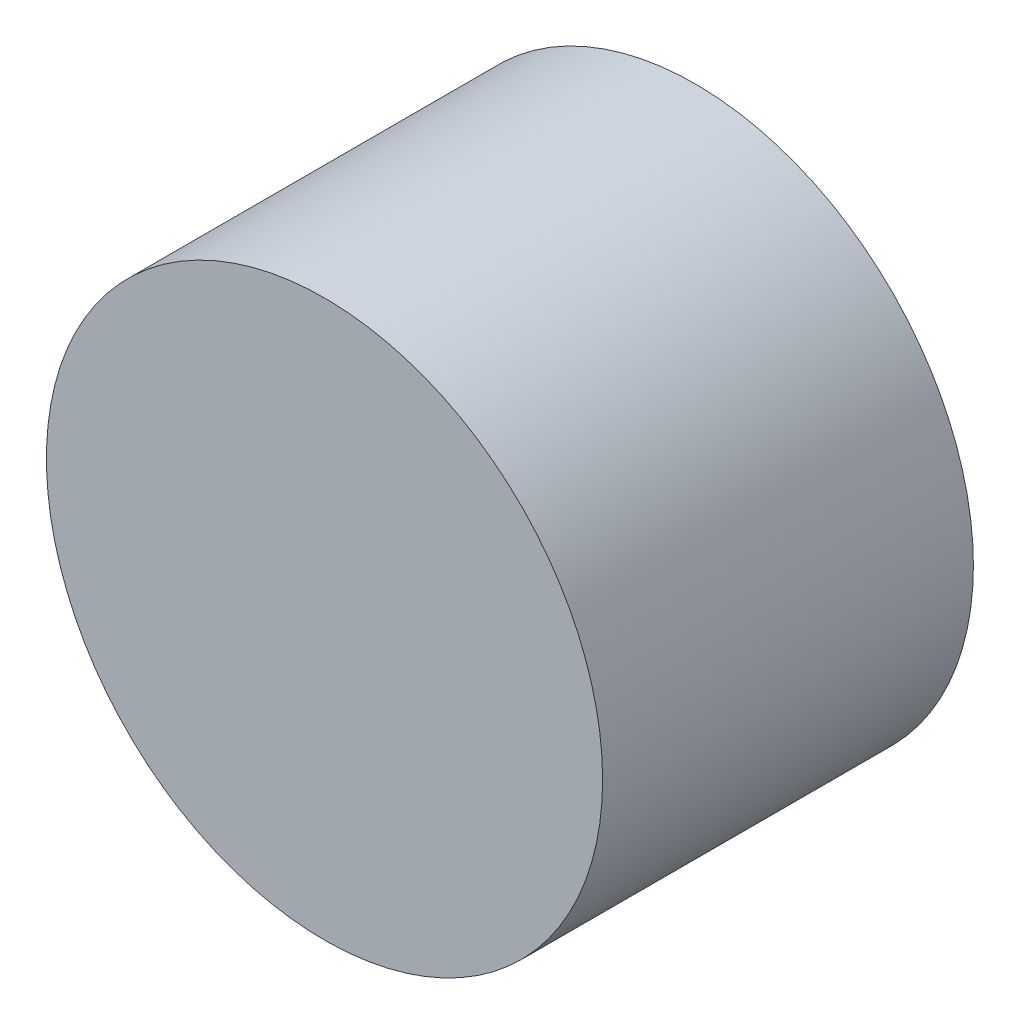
from build123d import *

# Parameters (mm, degrees)
SKETCH1_R           = 38.1
BOSS_EXTRUDE1_DEPTH = 25.4


with BuildPart() as part:
    # Sketch1 → Boss-Extrude1 (new, symmetric)
    with BuildSketch(Plane.XY):
        Circle(SKETCH1_R)
    extrude(amount=BOSS_EXTRUDE1_DEPTH, both=True)


solid = part.part
